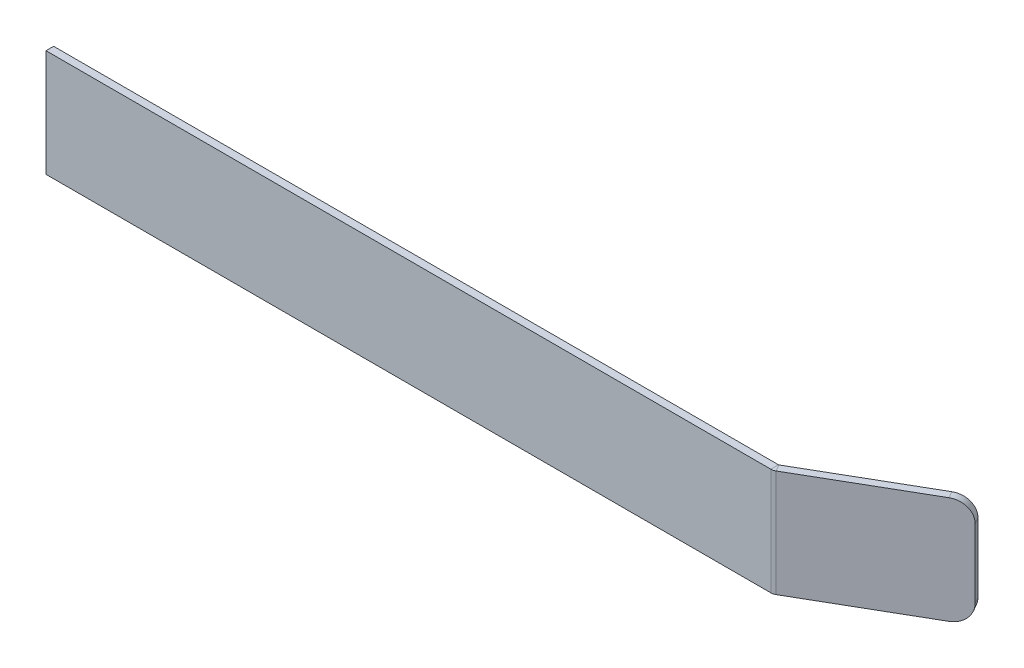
ISO-10303-21;
HEADER;
FILE_DESCRIPTION(('STEP AP214'),'2;1');
FILE_NAME('part.step','',(''),(''),'','','');
FILE_SCHEMA(('AUTOMOTIVE_DESIGN { 1 0 10303 214 1 1 1 1 }'));
ENDSEC;
DATA;
#1=APPLICATION_CONTEXT('core data for automotive mechanical design processes');
#2=APPLICATION_PROTOCOL_DEFINITION('international standard','automotive_design',2000,#1);
#3=PRODUCT_CONTEXT('',#1,'mechanical');
#4=PRODUCT('Part','Part','',(#3));
#5=PRODUCT_RELATED_PRODUCT_CATEGORY('part','',(#4));
#6=PRODUCT_DEFINITION_FORMATION('','',#4);
#7=PRODUCT_DEFINITION_CONTEXT('part definition',#1,'design');
#8=PRODUCT_DEFINITION('design','',#6,#7);
#9=PRODUCT_DEFINITION_SHAPE('','',#8);
#10=(LENGTH_UNIT() NAMED_UNIT(*) SI_UNIT(.MILLI.,.METRE.));
#11=(NAMED_UNIT(*) PLANE_ANGLE_UNIT() SI_UNIT($,.RADIAN.));
#12=(NAMED_UNIT(*) SI_UNIT($,.STERADIAN.) SOLID_ANGLE_UNIT());
#13=UNCERTAINTY_MEASURE_WITH_UNIT(LENGTH_MEASURE(1.E-05),#10,'distance_accuracy_value','');
#14=(GEOMETRIC_REPRESENTATION_CONTEXT(3) GLOBAL_UNCERTAINTY_ASSIGNED_CONTEXT((#13)) GLOBAL_UNIT_ASSIGNED_CONTEXT((#10,
#11,#12)) REPRESENTATION_CONTEXT('',''));
#15=CARTESIAN_POINT('',(0.,0.,0.));
#16=DIRECTION('',(0.,0.,1.));
#17=DIRECTION('',(1.,0.,0.));
#18=AXIS2_PLACEMENT_3D('',#15,#16,#17);
#19=CARTESIAN_POINT('',(129.707723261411,140.,483.812487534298));
#20=DIRECTION('',(-0.500000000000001,0.,-0.866025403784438));
#21=DIRECTION('',(-0.866025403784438,0.,0.500000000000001));
#22=AXIS2_PLACEMENT_3D('',#19,#20,#21);
#23=PLANE('',#22);
#24=DIRECTION('',(0.,1.,0.));
#25=VECTOR('',#24,1.);
#26=CARTESIAN_POINT('',(1117.84270897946,0.,-86.6875124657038));
#27=LINE('',#26,#25);
#28=CARTESIAN_POINT('',(1117.84270897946,25.,-86.6875124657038));
#29=VERTEX_POINT('',#28);
#30=CARTESIAN_POINT('',(1117.84270897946,115.,-86.6875124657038));
#31=VERTEX_POINT('',#30);
#32=EDGE_CURVE('E128',#29,#31,#27,.T.);
#33=ORIENTED_EDGE('',*,*,#32,.T.);
#34=CARTESIAN_POINT('',(1096.19207388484,115.,-74.1875124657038));
#35=DIRECTION('',(-0.500000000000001,0.,-0.866025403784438));
#36=DIRECTION('',(-0.866025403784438,0.,0.500000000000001));
#37=AXIS2_PLACEMENT_3D('',#34,#35,#36);
#38=CIRCLE('',#37,25.);
#39=CARTESIAN_POINT('',(1096.19207388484,140.,-74.1875124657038));
#40=VERTEX_POINT('',#39);
#41=EDGE_CURVE('E48',#31,#40,#38,.F.);
#42=ORIENTED_EDGE('',*,*,#41,.T.);
#43=DIRECTION('',(-0.866025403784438,0.,0.500000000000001));
#44=VECTOR('',#43,1.);
#45=CARTESIAN_POINT('',(129.707723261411,140.,483.812487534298));
#46=LINE('',#45,#44);
#47=CARTESIAN_POINT('',(952.866461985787,140.,8.56156896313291));
#48=VERTEX_POINT('',#47);
#49=EDGE_CURVE('E119',#40,#48,#46,.T.);
#50=ORIENTED_EDGE('',*,*,#49,.T.);
#51=DIRECTION('',(0.,-1.,0.));
#52=VECTOR('',#51,1.);
#53=CARTESIAN_POINT('',(952.866461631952,140.,8.56156835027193));
#54=LINE('',#53,#52);
#55=CARTESIAN_POINT('',(952.866461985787,0.,8.56156896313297));
#56=VERTEX_POINT('',#55);
#57=EDGE_CURVE('E122',#48,#56,#54,.T.);
#58=ORIENTED_EDGE('',*,*,#57,.T.);
#59=DIRECTION('',(0.866025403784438,0.,-0.500000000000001));
#60=VECTOR('',#59,1.);
#61=CARTESIAN_POINT('',(129.707723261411,0.,483.812487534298));
#62=LINE('',#61,#60);
#63=CARTESIAN_POINT('',(1096.19207388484,0.,-74.1875124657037));
#64=VERTEX_POINT('',#63);
#65=EDGE_CURVE('E167',#56,#64,#62,.T.);
#66=ORIENTED_EDGE('',*,*,#65,.T.);
#67=CARTESIAN_POINT('',(1096.19207388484,25.,-74.1875124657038));
#68=DIRECTION('',(-0.500000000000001,0.,-0.866025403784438));
#69=DIRECTION('',(-0.866025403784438,0.,0.500000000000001));
#70=AXIS2_PLACEMENT_3D('',#67,#68,#69);
#71=CIRCLE('',#70,25.);
#72=EDGE_CURVE('E178',#64,#29,#71,.F.);
#73=ORIENTED_EDGE('',*,*,#72,.T.);
#74=EDGE_LOOP('',(#33,#42,#50,#58,#66,#73));
#75=FACE_BOUND('',#74,.T.);
#76=ADVANCED_FACE('F40',(#75),#23,.F.);
#77=CARTESIAN_POINT('',(129.707723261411,140.,483.812487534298));
#78=DIRECTION('',(0.,-1.,0.));
#79=DIRECTION('',(-0.500000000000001,0.,-0.866025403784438));
#80=AXIS2_PLACEMENT_3D('',#77,#78,#79);
#81=PLANE('',#80);
#82=ORIENTED_EDGE('',*,*,#49,.F.);
#83=DIRECTION('',(-0.500000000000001,0.,-0.866025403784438));
#84=VECTOR('',#83,1.);
#85=CARTESIAN_POINT('',(1096.19207388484,140.,-74.1875124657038));
#86=LINE('',#85,#84);
#87=CARTESIAN_POINT('',(1091.19207388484,140.,-82.8477665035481));
#88=VERTEX_POINT('',#87);
#89=EDGE_CURVE('E161',#40,#88,#86,.T.);
#90=ORIENTED_EDGE('',*,*,#89,.T.);
#91=DIRECTION('',(-0.866025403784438,0.,0.500000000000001));
#92=VECTOR('',#91,1.);
#93=CARTESIAN_POINT('',(124.707723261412,140.,475.152233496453));
#94=LINE('',#93,#92);
#95=CARTESIAN_POINT('',(947.866461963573,140.,-0.0986851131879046));
#96=VERTEX_POINT('',#95);
#97=EDGE_CURVE('E152',#88,#96,#94,.T.);
#98=ORIENTED_EDGE('',*,*,#97,.T.);
#99=DIRECTION('',(0.500000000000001,0.,0.866025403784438));
#100=VECTOR('',#99,1.);
#101=CARTESIAN_POINT('',(952.866461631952,140.,8.56156835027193));
#102=LINE('',#101,#100);
#103=EDGE_CURVE('E137',#96,#48,#102,.T.);
#104=ORIENTED_EDGE('',*,*,#103,.T.);
#105=EDGE_LOOP('',(#82,#90,#98,#104));
#106=FACE_BOUND('',#105,.T.);
#107=ADVANCED_FACE('F150',(#106),#81,.F.);
#108=CARTESIAN_POINT('',(129.707723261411,0.,483.812487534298));
#109=DIRECTION('',(0.,1.,0.));
#110=DIRECTION('',(0.500000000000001,0.,0.866025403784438));
#111=AXIS2_PLACEMENT_3D('',#108,#109,#110);
#112=PLANE('',#111);
#113=DIRECTION('',(0.866025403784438,0.,-0.500000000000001));
#114=VECTOR('',#113,1.);
#115=CARTESIAN_POINT('',(124.707723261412,0.,475.152233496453));
#116=LINE('',#115,#114);
#117=CARTESIAN_POINT('',(947.866461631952,0.,-0.0986856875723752));
#118=VERTEX_POINT('',#117);
#119=CARTESIAN_POINT('',(1091.19207388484,0.,-82.8477665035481));
#120=VERTEX_POINT('',#119);
#121=EDGE_CURVE('E162',#118,#120,#116,.T.);
#122=ORIENTED_EDGE('',*,*,#121,.T.);
#123=DIRECTION('',(-0.500000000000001,0.,-0.866025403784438));
#124=VECTOR('',#123,1.);
#125=CARTESIAN_POINT('',(1096.19207388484,0.,-74.1875124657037));
#126=LINE('',#125,#124);
#127=EDGE_CURVE('E12',#120,#64,#126,.F.);
#128=ORIENTED_EDGE('',*,*,#127,.T.);
#129=ORIENTED_EDGE('',*,*,#65,.F.);
#130=DIRECTION('',(-0.500000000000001,0.,-0.866025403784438));
#131=VECTOR('',#130,1.);
#132=CARTESIAN_POINT('',(952.866461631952,0.,8.561568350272));
#133=LINE('',#132,#131);
#134=EDGE_CURVE('E155',#56,#118,#133,.T.);
#135=ORIENTED_EDGE('',*,*,#134,.T.);
#136=EDGE_LOOP('',(#122,#128,#129,#135));
#137=FACE_BOUND('',#136,.T.);
#138=ADVANCED_FACE('F189',(#137),#112,.F.);
#139=CARTESIAN_POINT('',(1117.84270897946,0.,-86.6875124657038));
#140=DIRECTION('',(-0.866025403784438,0.,0.500000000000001));
#141=DIRECTION('',(0.500000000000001,0.,0.866025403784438));
#142=AXIS2_PLACEMENT_3D('',#139,#140,#141);
#143=PLANE('',#142);
#144=DIRECTION('',(0.,1.,0.));
#145=VECTOR('',#144,1.);
#146=CARTESIAN_POINT('',(1112.84270897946,0.,-95.3477665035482));
#147=LINE('',#146,#145);
#148=CARTESIAN_POINT('',(1112.84270897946,25.,-95.3477665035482));
#149=VERTEX_POINT('',#148);
#150=CARTESIAN_POINT('',(1112.84270897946,115.,-95.3477665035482));
#151=VERTEX_POINT('',#150);
#152=EDGE_CURVE('E164',#149,#151,#147,.T.);
#153=ORIENTED_EDGE('',*,*,#152,.T.);
#154=DIRECTION('',(-0.500000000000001,0.,-0.866025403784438));
#155=VECTOR('',#154,1.);
#156=CARTESIAN_POINT('',(1117.84270897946,115.,-86.6875124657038));
#157=LINE('',#156,#155);
#158=EDGE_CURVE('E61',#151,#31,#157,.F.);
#159=ORIENTED_EDGE('',*,*,#158,.T.);
#160=ORIENTED_EDGE('',*,*,#32,.F.);
#161=DIRECTION('',(-0.500000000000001,0.,-0.866025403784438));
#162=VECTOR('',#161,1.);
#163=CARTESIAN_POINT('',(1117.84270897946,25.,-86.6875124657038));
#164=LINE('',#163,#162);
#165=EDGE_CURVE('E174',#29,#149,#164,.T.);
#166=ORIENTED_EDGE('',*,*,#165,.T.);
#167=EDGE_LOOP('',(#153,#159,#160,#166));
#168=FACE_BOUND('',#167,.T.);
#169=ADVANCED_FACE('F182',(#168),#143,.F.);
#170=CARTESIAN_POINT('',(124.707723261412,140.,475.152233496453));
#171=DIRECTION('',(-0.500000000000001,0.,-0.866025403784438));
#172=DIRECTION('',(-0.866025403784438,0.,0.500000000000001));
#173=AXIS2_PLACEMENT_3D('',#170,#171,#172);
#174=PLANE('',#173);
#175=ORIENTED_EDGE('',*,*,#97,.F.);
#176=CARTESIAN_POINT('',(1091.19207388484,115.,-82.8477665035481));
#177=DIRECTION('',(-0.500000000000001,0.,-0.866025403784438));
#178=DIRECTION('',(-0.866025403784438,0.,0.500000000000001));
#179=AXIS2_PLACEMENT_3D('',#176,#177,#178);
#180=CIRCLE('',#179,25.);
#181=EDGE_CURVE('E172',#88,#151,#180,.T.);
#182=ORIENTED_EDGE('',*,*,#181,.T.);
#183=ORIENTED_EDGE('',*,*,#152,.F.);
#184=CARTESIAN_POINT('',(1091.19207388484,25.,-82.8477665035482));
#185=DIRECTION('',(-0.500000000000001,0.,-0.866025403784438));
#186=DIRECTION('',(-0.866025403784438,0.,0.500000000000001));
#187=AXIS2_PLACEMENT_3D('',#184,#185,#186);
#188=CIRCLE('',#187,25.);
#189=EDGE_CURVE('E170',#149,#120,#188,.T.);
#190=ORIENTED_EDGE('',*,*,#189,.T.);
#191=ORIENTED_EDGE('',*,*,#121,.F.);
#192=DIRECTION('',(0.,-1.,0.));
#193=VECTOR('',#192,1.);
#194=CARTESIAN_POINT('',(947.866461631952,140.,-0.0986856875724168));
#195=LINE('',#194,#193);
#196=EDGE_CURVE('E153',#96,#118,#195,.T.);
#197=ORIENTED_EDGE('',*,*,#196,.F.);
#198=EDGE_LOOP('',(#175,#182,#183,#190,#191,#197));
#199=FACE_BOUND('',#198,.T.);
#200=ADVANCED_FACE('F187',(#199),#174,.T.);
#201=CARTESIAN_POINT('',(0.,0.,9.99999999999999));
#202=DIRECTION('',(1.,0.,0.));
#203=DIRECTION('',(0.,0.,-1.));
#204=AXIS2_PLACEMENT_3D('',#201,#202,#203);
#205=PLANE('',#204);
#206=DIRECTION('',(0.,-1.,0.));
#207=VECTOR('',#206,1.);
#208=CARTESIAN_POINT('',(0.,0.,0.));
#209=LINE('',#208,#207);
#210=CARTESIAN_POINT('',(0.,140.,0.));
#211=VERTEX_POINT('',#210);
#212=CARTESIAN_POINT('',(0.,0.,0.));
#213=VERTEX_POINT('',#212);
#214=EDGE_CURVE('E223',#211,#213,#209,.T.);
#215=ORIENTED_EDGE('',*,*,#214,.T.);
#216=DIRECTION('',(0.,0.,-1.));
#217=VECTOR('',#216,1.);
#218=CARTESIAN_POINT('',(0.,0.,9.99999999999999));
#219=LINE('',#218,#217);
#220=CARTESIAN_POINT('',(0.,0.,9.99999999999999));
#221=VERTEX_POINT('',#220);
#222=EDGE_CURVE('E205',#221,#213,#219,.T.);
#223=ORIENTED_EDGE('',*,*,#222,.F.);
#224=DIRECTION('',(0.,-1.,0.));
#225=VECTOR('',#224,1.);
#226=CARTESIAN_POINT('',(0.,0.,9.99999999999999));
#227=LINE('',#226,#225);
#228=CARTESIAN_POINT('',(0.,140.,9.99999999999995));
#229=VERTEX_POINT('',#228);
#230=EDGE_CURVE('E215',#229,#221,#227,.T.);
#231=ORIENTED_EDGE('',*,*,#230,.F.);
#232=DIRECTION('',(0.,0.,-1.));
#233=VECTOR('',#232,1.);
#234=CARTESIAN_POINT('',(0.,140.,9.99999999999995));
#235=LINE('',#234,#233);
#236=EDGE_CURVE('E220',#229,#211,#235,.T.);
#237=ORIENTED_EDGE('',*,*,#236,.T.);
#238=EDGE_LOOP('',(#215,#223,#231,#237));
#239=FACE_BOUND('',#238,.T.);
#240=ADVANCED_FACE('F246',(#239),#205,.F.);
#241=CARTESIAN_POINT('',(0.,140.,9.99999999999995));
#242=DIRECTION('',(0.,0.,-1.));
#243=DIRECTION('',(-1.,0.,0.));
#244=AXIS2_PLACEMENT_3D('',#241,#242,#243);
#245=PLANE('',#244);
#246=DIRECTION('',(0.,-1.,0.));
#247=VECTOR('',#246,1.);
#248=CARTESIAN_POINT('',(947.498161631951,140.,9.99999999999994));
#249=LINE('',#248,#247);
#250=CARTESIAN_POINT('',(947.498161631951,140.,10.0000006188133));
#251=VERTEX_POINT('',#250);
#252=CARTESIAN_POINT('',(947.498161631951,0.,9.99999999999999));
#253=VERTEX_POINT('',#252);
#254=EDGE_CURVE('E228',#251,#253,#249,.T.);
#255=ORIENTED_EDGE('',*,*,#254,.F.);
#256=DIRECTION('',(-1.,0.,0.));
#257=VECTOR('',#256,1.);
#258=CARTESIAN_POINT('',(0.,140.,9.99999999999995));
#259=LINE('',#258,#257);
#260=EDGE_CURVE('E218',#251,#229,#259,.T.);
#261=ORIENTED_EDGE('',*,*,#260,.T.);
#262=ORIENTED_EDGE('',*,*,#230,.T.);
#263=DIRECTION('',(1.,0.,0.));
#264=VECTOR('',#263,1.);
#265=CARTESIAN_POINT('',(0.,0.,9.99999999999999));
#266=LINE('',#265,#264);
#267=EDGE_CURVE('E213',#221,#253,#266,.T.);
#268=ORIENTED_EDGE('',*,*,#267,.T.);
#269=EDGE_LOOP('',(#255,#261,#262,#268));
#270=FACE_BOUND('',#269,.T.);
#271=ADVANCED_FACE('F241',(#270),#245,.F.);
#272=CARTESIAN_POINT('',(0.,140.,9.99999999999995));
#273=DIRECTION('',(0.,-1.,0.));
#274=DIRECTION('',(0.,0.,-1.));
#275=AXIS2_PLACEMENT_3D('',#272,#273,#274);
#276=PLANE('',#275);
#277=DIRECTION('',(0.,0.,1.));
#278=VECTOR('',#277,1.);
#279=CARTESIAN_POINT('',(947.498161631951,140.,9.99999999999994));
#280=LINE('',#279,#278);
#281=CARTESIAN_POINT('',(947.498161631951,140.,0.));
#282=VERTEX_POINT('',#281);
#283=EDGE_CURVE('E140',#282,#251,#280,.T.);
#284=ORIENTED_EDGE('',*,*,#283,.F.);
#285=DIRECTION('',(-1.,0.,0.));
#286=VECTOR('',#285,1.);
#287=CARTESIAN_POINT('',(0.,140.,0.));
#288=LINE('',#287,#286);
#289=EDGE_CURVE('E211',#282,#211,#288,.T.);
#290=ORIENTED_EDGE('',*,*,#289,.T.);
#291=ORIENTED_EDGE('',*,*,#236,.F.);
#292=ORIENTED_EDGE('',*,*,#260,.F.);
#293=EDGE_LOOP('',(#284,#290,#291,#292));
#294=FACE_BOUND('',#293,.T.);
#295=ADVANCED_FACE('F237',(#294),#276,.F.);
#296=CARTESIAN_POINT('',(0.,140.,0.));
#297=DIRECTION('',(0.,0.,-1.));
#298=DIRECTION('',(-1.,0.,0.));
#299=AXIS2_PLACEMENT_3D('',#296,#297,#298);
#300=PLANE('',#299);
#301=ORIENTED_EDGE('',*,*,#289,.F.);
#302=DIRECTION('',(0.,-1.,0.));
#303=VECTOR('',#302,1.);
#304=CARTESIAN_POINT('',(947.498161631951,140.,0.));
#305=LINE('',#304,#303);
#306=CARTESIAN_POINT('',(947.498161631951,0.,0.));
#307=VERTEX_POINT('',#306);
#308=EDGE_CURVE('E208',#282,#307,#305,.T.);
#309=ORIENTED_EDGE('',*,*,#308,.T.);
#310=DIRECTION('',(1.,0.,0.));
#311=VECTOR('',#310,1.);
#312=CARTESIAN_POINT('',(0.,0.,0.));
#313=LINE('',#312,#311);
#314=EDGE_CURVE('E165',#213,#307,#313,.T.);
#315=ORIENTED_EDGE('',*,*,#314,.F.);
#316=ORIENTED_EDGE('',*,*,#214,.F.);
#317=EDGE_LOOP('',(#301,#309,#315,#316));
#318=FACE_BOUND('',#317,.T.);
#319=ADVANCED_FACE('F233',(#318),#300,.T.);
#320=CARTESIAN_POINT('',(0.,0.,9.99999999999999));
#321=DIRECTION('',(0.,1.,0.));
#322=DIRECTION('',(0.,0.,1.));
#323=AXIS2_PLACEMENT_3D('',#320,#321,#322);
#324=PLANE('',#323);
#325=DIRECTION('',(0.,0.,-1.));
#326=VECTOR('',#325,1.);
#327=CARTESIAN_POINT('',(947.498161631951,0.,9.99999999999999));
#328=LINE('',#327,#326);
#329=EDGE_CURVE('E196',#253,#307,#328,.T.);
#330=ORIENTED_EDGE('',*,*,#329,.F.);
#331=ORIENTED_EDGE('',*,*,#267,.F.);
#332=ORIENTED_EDGE('',*,*,#222,.T.);
#333=ORIENTED_EDGE('',*,*,#314,.T.);
#334=EDGE_LOOP('',(#330,#331,#332,#333));
#335=FACE_BOUND('',#334,.T.);
#336=ADVANCED_FACE('F244',(#335),#324,.F.);
#337=CARTESIAN_POINT('',(947.498161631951,140.,-0.736600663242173));
#338=DIRECTION('',(0.,1.,0.));
#339=DIRECTION('',(0.,0.,1.));
#340=AXIS2_PLACEMENT_3D('',#337,#338,#339);
#341=PLANE('',#340);
#342=ORIENTED_EDGE('',*,*,#103,.F.);
#343=CARTESIAN_POINT('',(947.498161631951,140.,-0.736600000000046));
#344=DIRECTION('',(0.,1.,0.));
#345=DIRECTION('',(0.,0.,1.));
#346=AXIS2_PLACEMENT_3D('',#343,#344,#345);
#347=CIRCLE('',#346,0.736600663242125);
#348=EDGE_CURVE('E199',#96,#282,#347,.F.);
#349=ORIENTED_EDGE('',*,*,#348,.T.);
#350=ORIENTED_EDGE('',*,*,#283,.T.);
#351=CARTESIAN_POINT('',(947.498161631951,140.,-0.736600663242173));
#352=DIRECTION('',(0.,-1.,0.));
#353=DIRECTION('',(0.,0.,-1.));
#354=AXIS2_PLACEMENT_3D('',#351,#352,#353);
#355=CIRCLE('',#354,10.7366012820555);
#356=EDGE_CURVE('E134',#48,#251,#355,.T.);
#357=ORIENTED_EDGE('',*,*,#356,.F.);
#358=EDGE_LOOP('',(#342,#349,#350,#357));
#359=FACE_BOUND('',#358,.T.);
#360=ADVANCED_FACE('F135',(#359),#341,.T.);
#361=CARTESIAN_POINT('',(947.498161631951,0.,-0.736600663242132));
#362=DIRECTION('',(0.,-1.,0.));
#363=DIRECTION('',(0.,0.,-1.));
#364=AXIS2_PLACEMENT_3D('',#361,#362,#363);
#365=PLANE('',#364);
#366=ORIENTED_EDGE('',*,*,#329,.T.);
#367=CARTESIAN_POINT('',(947.498161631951,0.,-0.736600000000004));
#368=DIRECTION('',(0.,1.,0.));
#369=DIRECTION('',(0.,0.,1.));
#370=AXIS2_PLACEMENT_3D('',#367,#368,#369);
#371=CIRCLE('',#370,0.736600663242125);
#372=EDGE_CURVE('E144',#307,#118,#371,.T.);
#373=ORIENTED_EDGE('',*,*,#372,.T.);
#374=ORIENTED_EDGE('',*,*,#134,.F.);
#375=CARTESIAN_POINT('',(947.498161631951,0.,-0.736600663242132));
#376=DIRECTION('',(0.,1.,0.));
#377=DIRECTION('',(0.,0.,1.));
#378=AXIS2_PLACEMENT_3D('',#375,#376,#377);
#379=CIRCLE('',#378,10.7366012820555);
#380=EDGE_CURVE('E143',#253,#56,#379,.T.);
#381=ORIENTED_EDGE('',*,*,#380,.F.);
#382=EDGE_LOOP('',(#366,#373,#374,#381));
#383=FACE_BOUND('',#382,.T.);
#384=ADVANCED_FACE('F193',(#383),#365,.T.);
#385=CARTESIAN_POINT('',(947.498161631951,-70.3888246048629,-0.736600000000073));
#386=DIRECTION('',(0.,1.,0.));
#387=DIRECTION('',(0.,0.,1.));
#388=AXIS2_PLACEMENT_3D('',#385,#386,#387);
#389=CYLINDRICAL_SURFACE('',#388,10.7366006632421);
#390=ORIENTED_EDGE('',*,*,#380,.T.);
#391=ORIENTED_EDGE('',*,*,#57,.F.);
#392=ORIENTED_EDGE('',*,*,#356,.T.);
#393=ORIENTED_EDGE('',*,*,#254,.T.);
#394=EDGE_LOOP('',(#390,#391,#392,#393));
#395=FACE_BOUND('',#394,.T.);
#396=ADVANCED_FACE('F147',(#395),#389,.T.);
#397=CARTESIAN_POINT('',(947.498161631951,-70.3888246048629,-0.736600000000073));
#398=DIRECTION('',(0.,1.,0.));
#399=DIRECTION('',(0.,0.,1.));
#400=AXIS2_PLACEMENT_3D('',#397,#398,#399);
#401=CYLINDRICAL_SURFACE('',#400,0.736600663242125);
#402=ORIENTED_EDGE('',*,*,#372,.F.);
#403=ORIENTED_EDGE('',*,*,#308,.F.);
#404=ORIENTED_EDGE('',*,*,#348,.F.);
#405=ORIENTED_EDGE('',*,*,#196,.T.);
#406=EDGE_LOOP('',(#402,#403,#404,#405));
#407=FACE_BOUND('',#406,.T.);
#408=ADVANCED_FACE('F231',(#407),#401,.F.);
#409=CARTESIAN_POINT('',(1096.19207388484,115.,-74.1875124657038));
#410=DIRECTION('',(-0.500000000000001,0.,-0.866025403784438));
#411=DIRECTION('',(-0.866025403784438,0.,0.500000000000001));
#412=AXIS2_PLACEMENT_3D('',#409,#410,#411);
#413=CYLINDRICAL_SURFACE('',#412,25.);
#414=ORIENTED_EDGE('',*,*,#41,.F.);
#415=ORIENTED_EDGE('',*,*,#158,.F.);
#416=ORIENTED_EDGE('',*,*,#181,.F.);
#417=ORIENTED_EDGE('',*,*,#89,.F.);
#418=EDGE_LOOP('',(#414,#415,#416,#417));
#419=FACE_BOUND('',#418,.T.);
#420=ADVANCED_FACE('F230',(#419),#413,.T.);
#421=CARTESIAN_POINT('',(1096.19207388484,25.,-74.1875124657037));
#422=DIRECTION('',(-0.500000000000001,0.,-0.866025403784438));
#423=DIRECTION('',(-0.866025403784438,0.,0.500000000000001));
#424=AXIS2_PLACEMENT_3D('',#421,#422,#423);
#425=CYLINDRICAL_SURFACE('',#424,25.);
#426=ORIENTED_EDGE('',*,*,#72,.F.);
#427=ORIENTED_EDGE('',*,*,#127,.F.);
#428=ORIENTED_EDGE('',*,*,#189,.F.);
#429=ORIENTED_EDGE('',*,*,#165,.F.);
#430=EDGE_LOOP('',(#426,#427,#428,#429));
#431=FACE_BOUND('',#430,.T.);
#432=ADVANCED_FACE('F42',(#431),#425,.T.);
#433=CLOSED_SHELL('',(#76,#107,#138,#169,#200,#240,#271,#295,#319,#336,#360,#384,#396,#408,#420,#432));
#434=MANIFOLD_SOLID_BREP('B2',#433);
#435=ADVANCED_BREP_SHAPE_REPRESENTATION('',(#18,#434),#14);
#436=SHAPE_DEFINITION_REPRESENTATION(#9,#435);
ENDSEC;
END-ISO-10303-21;
